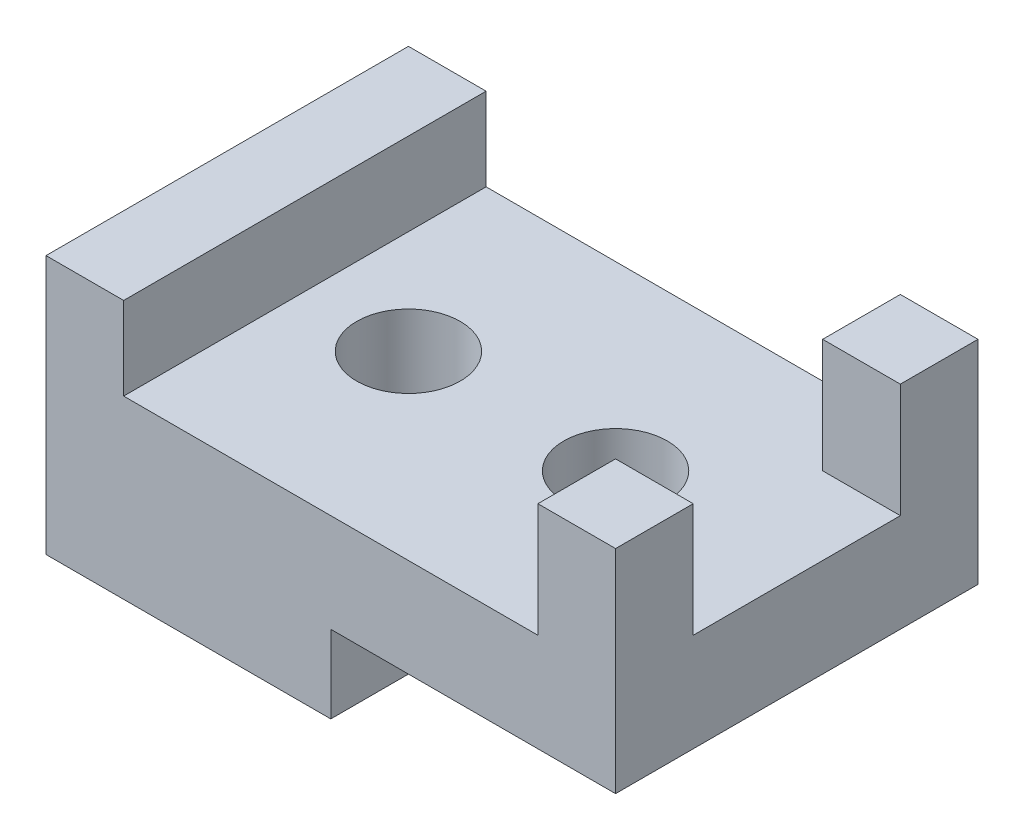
ISO-10303-21;
HEADER;
FILE_DESCRIPTION(('STEP AP214'),'2;1');
FILE_NAME('part.step','',(''),(''),'','','');
FILE_SCHEMA(('AUTOMOTIVE_DESIGN { 1 0 10303 214 1 1 1 1 }'));
ENDSEC;
DATA;
#1=APPLICATION_CONTEXT('core data for automotive mechanical design processes');
#2=APPLICATION_PROTOCOL_DEFINITION('international standard','automotive_design',2000,#1);
#3=PRODUCT_CONTEXT('',#1,'mechanical');
#4=PRODUCT('Part','Part','',(#3));
#5=PRODUCT_RELATED_PRODUCT_CATEGORY('part','',(#4));
#6=PRODUCT_DEFINITION_FORMATION('','',#4);
#7=PRODUCT_DEFINITION_CONTEXT('part definition',#1,'design');
#8=PRODUCT_DEFINITION('design','',#6,#7);
#9=PRODUCT_DEFINITION_SHAPE('','',#8);
#10=(LENGTH_UNIT() NAMED_UNIT(*) SI_UNIT(.MILLI.,.METRE.));
#11=(NAMED_UNIT(*) PLANE_ANGLE_UNIT() SI_UNIT($,.RADIAN.));
#12=(NAMED_UNIT(*) SI_UNIT($,.STERADIAN.) SOLID_ANGLE_UNIT());
#13=UNCERTAINTY_MEASURE_WITH_UNIT(LENGTH_MEASURE(1.E-05),#10,'distance_accuracy_value','');
#14=(GEOMETRIC_REPRESENTATION_CONTEXT(3) GLOBAL_UNCERTAINTY_ASSIGNED_CONTEXT((#13)) GLOBAL_UNIT_ASSIGNED_CONTEXT((#10,
#11,#12)) REPRESENTATION_CONTEXT('',''));
#15=CARTESIAN_POINT('',(0.,0.,0.));
#16=DIRECTION('',(0.,0.,1.));
#17=DIRECTION('',(1.,0.,0.));
#18=AXIS2_PLACEMENT_3D('',#15,#16,#17);
#19=CARTESIAN_POINT('',(110.,-16.,70.));
#20=DIRECTION('',(0.,-1.,0.));
#21=DIRECTION('',(1.,0.,0.));
#22=AXIS2_PLACEMENT_3D('',#19,#20,#21);
#23=PLANE('',#22);
#24=CARTESIAN_POINT('',(75.,-16.,35.));
#25=DIRECTION('',(0.,1.,0.));
#26=DIRECTION('',(-1.,0.,0.));
#27=AXIS2_PLACEMENT_3D('',#24,#25,#26);
#28=CIRCLE('',#27,9.99999999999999);
#29=CARTESIAN_POINT('',(65.,-16.,35.));
#30=VERTEX_POINT('',#29);
#31=EDGE_CURVE('E559',#30,#30,#28,.T.);
#32=ORIENTED_EDGE('',*,*,#31,.F.);
#33=EDGE_LOOP('',(#32));
#34=FACE_BOUND('',#33,.T.);
#35=CARTESIAN_POINT('',(35.,-16.,35.));
#36=DIRECTION('',(0.,1.,0.));
#37=DIRECTION('',(-1.,0.,0.));
#38=AXIS2_PLACEMENT_3D('',#35,#36,#37);
#39=CIRCLE('',#38,10.);
#40=CARTESIAN_POINT('',(25.,-16.,35.));
#41=VERTEX_POINT('',#40);
#42=EDGE_CURVE('E168',#41,#41,#39,.T.);
#43=ORIENTED_EDGE('',*,*,#42,.F.);
#44=EDGE_LOOP('',(#43));
#45=FACE_BOUND('',#44,.T.);
#46=DIRECTION('',(0.,0.,1.));
#47=VECTOR('',#46,1.);
#48=CARTESIAN_POINT('',(95.,-16.,0.));
#49=LINE('',#48,#47);
#50=CARTESIAN_POINT('',(95.,-16.,0.));
#51=VERTEX_POINT('',#50);
#52=CARTESIAN_POINT('',(95.,-16.,15.));
#53=VERTEX_POINT('',#52);
#54=EDGE_CURVE('E159',#51,#53,#49,.T.);
#55=ORIENTED_EDGE('',*,*,#54,.F.);
#56=DIRECTION('',(-1.,0.,0.));
#57=VECTOR('',#56,1.);
#58=CARTESIAN_POINT('',(110.,-16.,0.));
#59=LINE('',#58,#57);
#60=CARTESIAN_POINT('',(15.,-16.,0.));
#61=VERTEX_POINT('',#60);
#62=EDGE_CURVE('E147',#51,#61,#59,.T.);
#63=ORIENTED_EDGE('',*,*,#62,.T.);
#64=DIRECTION('',(0.,0.,-1.));
#65=VECTOR('',#64,1.);
#66=CARTESIAN_POINT('',(15.,-16.,70.));
#67=LINE('',#66,#65);
#68=CARTESIAN_POINT('',(15.,-16.,70.));
#69=VERTEX_POINT('',#68);
#70=EDGE_CURVE('E241',#69,#61,#67,.T.);
#71=ORIENTED_EDGE('',*,*,#70,.F.);
#72=DIRECTION('',(-1.,0.,0.));
#73=VECTOR('',#72,1.);
#74=CARTESIAN_POINT('',(110.,-16.,70.));
#75=LINE('',#74,#73);
#76=CARTESIAN_POINT('',(95.,-16.,70.));
#77=VERTEX_POINT('',#76);
#78=EDGE_CURVE('E222',#77,#69,#75,.T.);
#79=ORIENTED_EDGE('',*,*,#78,.F.);
#80=DIRECTION('',(0.,0.,1.));
#81=VECTOR('',#80,1.);
#82=CARTESIAN_POINT('',(95.,-16.,70.));
#83=LINE('',#82,#81);
#84=CARTESIAN_POINT('',(95.,-16.,55.));
#85=VERTEX_POINT('',#84);
#86=EDGE_CURVE('E191',#85,#77,#83,.T.);
#87=ORIENTED_EDGE('',*,*,#86,.F.);
#88=DIRECTION('',(-1.,0.,0.));
#89=VECTOR('',#88,1.);
#90=CARTESIAN_POINT('',(110.,-16.,55.));
#91=LINE('',#90,#89);
#92=CARTESIAN_POINT('',(110.,-16.,55.));
#93=VERTEX_POINT('',#92);
#94=EDGE_CURVE('E163',#93,#85,#91,.T.);
#95=ORIENTED_EDGE('',*,*,#94,.F.);
#96=DIRECTION('',(0.,0.,-1.));
#97=VECTOR('',#96,1.);
#98=CARTESIAN_POINT('',(110.,-16.,70.));
#99=LINE('',#98,#97);
#100=CARTESIAN_POINT('',(110.,-16.,15.));
#101=VERTEX_POINT('',#100);
#102=EDGE_CURVE('E66',#93,#101,#99,.T.);
#103=ORIENTED_EDGE('',*,*,#102,.T.);
#104=DIRECTION('',(1.,0.,0.));
#105=VECTOR('',#104,1.);
#106=CARTESIAN_POINT('',(110.,-16.,15.));
#107=LINE('',#106,#105);
#108=EDGE_CURVE('E61',#53,#101,#107,.T.);
#109=ORIENTED_EDGE('',*,*,#108,.F.);
#110=EDGE_LOOP('',(#55,#63,#71,#79,#87,#95,#103,#109));
#111=FACE_BOUND('',#110,.T.);
#112=ADVANCED_FACE('F45',(#34,#45,#111),#23,.F.);
#113=CARTESIAN_POINT('',(15.,0.,70.));
#114=DIRECTION('',(0.,-1.,0.));
#115=DIRECTION('',(1.,0.,0.));
#116=AXIS2_PLACEMENT_3D('',#113,#114,#115);
#117=PLANE('',#116);
#118=DIRECTION('',(-1.,0.,0.));
#119=VECTOR('',#118,1.);
#120=CARTESIAN_POINT('',(15.,0.,0.));
#121=LINE('',#120,#119);
#122=CARTESIAN_POINT('',(15.,0.,0.));
#123=VERTEX_POINT('',#122);
#124=CARTESIAN_POINT('',(0.,0.,0.));
#125=VERTEX_POINT('',#124);
#126=EDGE_CURVE('E208',#123,#125,#121,.T.);
#127=ORIENTED_EDGE('',*,*,#126,.T.);
#128=DIRECTION('',(0.,0.,-1.));
#129=VECTOR('',#128,1.);
#130=CARTESIAN_POINT('',(0.,0.,70.));
#131=LINE('',#130,#129);
#132=CARTESIAN_POINT('',(0.,0.,70.));
#133=VERTEX_POINT('',#132);
#134=EDGE_CURVE('E11',#133,#125,#131,.T.);
#135=ORIENTED_EDGE('',*,*,#134,.F.);
#136=DIRECTION('',(-1.,0.,0.));
#137=VECTOR('',#136,1.);
#138=CARTESIAN_POINT('',(15.,0.,70.));
#139=LINE('',#138,#137);
#140=CARTESIAN_POINT('',(15.,0.,70.));
#141=VERTEX_POINT('',#140);
#142=EDGE_CURVE('E209',#141,#133,#139,.T.);
#143=ORIENTED_EDGE('',*,*,#142,.F.);
#144=DIRECTION('',(0.,0.,-1.));
#145=VECTOR('',#144,1.);
#146=CARTESIAN_POINT('',(15.,0.,70.));
#147=LINE('',#146,#145);
#148=EDGE_CURVE('E226',#141,#123,#147,.T.);
#149=ORIENTED_EDGE('',*,*,#148,.T.);
#150=EDGE_LOOP('',(#127,#135,#143,#149));
#151=FACE_BOUND('',#150,.T.);
#152=ADVANCED_FACE('F47',(#151),#117,.F.);
#153=CARTESIAN_POINT('',(0.,0.,70.));
#154=DIRECTION('',(1.,0.,0.));
#155=DIRECTION('',(0.,0.,-1.));
#156=AXIS2_PLACEMENT_3D('',#153,#154,#155);
#157=PLANE('',#156);
#158=DIRECTION('',(0.,-1.,0.));
#159=VECTOR('',#158,1.);
#160=CARTESIAN_POINT('',(0.,0.,0.));
#161=LINE('',#160,#159);
#162=CARTESIAN_POINT('',(0.,-50.,0.));
#163=VERTEX_POINT('',#162);
#164=EDGE_CURVE('E229',#125,#163,#161,.T.);
#165=ORIENTED_EDGE('',*,*,#164,.T.);
#166=DIRECTION('',(0.,0.,-1.));
#167=VECTOR('',#166,1.);
#168=CARTESIAN_POINT('',(0.,-50.,70.));
#169=LINE('',#168,#167);
#170=CARTESIAN_POINT('',(0.,-50.,70.));
#171=VERTEX_POINT('',#170);
#172=EDGE_CURVE('E54',#171,#163,#169,.T.);
#173=ORIENTED_EDGE('',*,*,#172,.F.);
#174=DIRECTION('',(0.,-1.,0.));
#175=VECTOR('',#174,1.);
#176=CARTESIAN_POINT('',(0.,0.,70.));
#177=LINE('',#176,#175);
#178=EDGE_CURVE('E212',#133,#171,#177,.T.);
#179=ORIENTED_EDGE('',*,*,#178,.F.);
#180=ORIENTED_EDGE('',*,*,#134,.T.);
#181=EDGE_LOOP('',(#165,#173,#179,#180));
#182=FACE_BOUND('',#181,.T.);
#183=ADVANCED_FACE('F278',(#182),#157,.F.);
#184=CARTESIAN_POINT('',(0.,-50.,70.));
#185=DIRECTION('',(0.,1.,0.));
#186=DIRECTION('',(0.,0.,1.));
#187=AXIS2_PLACEMENT_3D('',#184,#185,#186);
#188=PLANE('',#187);
#189=DIRECTION('',(1.,0.,0.));
#190=VECTOR('',#189,1.);
#191=CARTESIAN_POINT('',(0.,-50.,0.));
#192=LINE('',#191,#190);
#193=CARTESIAN_POINT('',(55.,-50.,0.));
#194=VERTEX_POINT('',#193);
#195=EDGE_CURVE('E231',#163,#194,#192,.T.);
#196=ORIENTED_EDGE('',*,*,#195,.T.);
#197=DIRECTION('',(0.,0.,-1.));
#198=VECTOR('',#197,1.);
#199=CARTESIAN_POINT('',(55.,-50.,70.));
#200=LINE('',#199,#198);
#201=CARTESIAN_POINT('',(55.,-50.,70.));
#202=VERTEX_POINT('',#201);
#203=EDGE_CURVE('E250',#202,#194,#200,.T.);
#204=ORIENTED_EDGE('',*,*,#203,.F.);
#205=DIRECTION('',(1.,0.,0.));
#206=VECTOR('',#205,1.);
#207=CARTESIAN_POINT('',(0.,-50.,70.));
#208=LINE('',#207,#206);
#209=EDGE_CURVE('E214',#171,#202,#208,.T.);
#210=ORIENTED_EDGE('',*,*,#209,.F.);
#211=ORIENTED_EDGE('',*,*,#172,.T.);
#212=EDGE_LOOP('',(#196,#204,#210,#211));
#213=FACE_BOUND('',#212,.T.);
#214=ADVANCED_FACE('F258',(#213),#188,.F.);
#215=CARTESIAN_POINT('',(55.,-50.,70.));
#216=DIRECTION('',(-1.,0.,0.));
#217=DIRECTION('',(0.,0.,1.));
#218=AXIS2_PLACEMENT_3D('',#215,#216,#217);
#219=PLANE('',#218);
#220=DIRECTION('',(0.,1.,0.));
#221=VECTOR('',#220,1.);
#222=CARTESIAN_POINT('',(55.,-50.,0.));
#223=LINE('',#222,#221);
#224=CARTESIAN_POINT('',(55.,-35.,0.));
#225=VERTEX_POINT('',#224);
#226=EDGE_CURVE('E233',#194,#225,#223,.T.);
#227=ORIENTED_EDGE('',*,*,#226,.T.);
#228=DIRECTION('',(0.,0.,-1.));
#229=VECTOR('',#228,1.);
#230=CARTESIAN_POINT('',(55.,-35.,70.));
#231=LINE('',#230,#229);
#232=CARTESIAN_POINT('',(55.,-35.,70.));
#233=VERTEX_POINT('',#232);
#234=EDGE_CURVE('E247',#233,#225,#231,.T.);
#235=ORIENTED_EDGE('',*,*,#234,.F.);
#236=DIRECTION('',(0.,1.,0.));
#237=VECTOR('',#236,1.);
#238=CARTESIAN_POINT('',(55.,-50.,70.));
#239=LINE('',#238,#237);
#240=EDGE_CURVE('E216',#202,#233,#239,.T.);
#241=ORIENTED_EDGE('',*,*,#240,.F.);
#242=ORIENTED_EDGE('',*,*,#203,.T.);
#243=EDGE_LOOP('',(#227,#235,#241,#242));
#244=FACE_BOUND('',#243,.T.);
#245=ADVANCED_FACE('F266',(#244),#219,.F.);
#246=CARTESIAN_POINT('',(55.,-35.,70.));
#247=DIRECTION('',(0.,1.,0.));
#248=DIRECTION('',(0.,0.,1.));
#249=AXIS2_PLACEMENT_3D('',#246,#247,#248);
#250=PLANE('',#249);
#251=CARTESIAN_POINT('',(75.,-35.,35.));
#252=DIRECTION('',(0.,1.,0.));
#253=DIRECTION('',(0.,0.,1.));
#254=AXIS2_PLACEMENT_3D('',#251,#252,#253);
#255=CIRCLE('',#254,9.99999999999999);
#256=CARTESIAN_POINT('',(75.,-35.,45.));
#257=VERTEX_POINT('',#256);
#258=EDGE_CURVE('E49',#257,#257,#255,.T.);
#259=ORIENTED_EDGE('',*,*,#258,.T.);
#260=EDGE_LOOP('',(#259));
#261=FACE_BOUND('',#260,.T.);
#262=DIRECTION('',(1.,0.,0.));
#263=VECTOR('',#262,1.);
#264=CARTESIAN_POINT('',(55.,-35.,0.));
#265=LINE('',#264,#263);
#266=CARTESIAN_POINT('',(110.,-35.,0.));
#267=VERTEX_POINT('',#266);
#268=EDGE_CURVE('E235',#225,#267,#265,.T.);
#269=ORIENTED_EDGE('',*,*,#268,.T.);
#270=DIRECTION('',(0.,0.,-1.));
#271=VECTOR('',#270,1.);
#272=CARTESIAN_POINT('',(110.,-35.,70.));
#273=LINE('',#272,#271);
#274=CARTESIAN_POINT('',(110.,-35.,70.));
#275=VERTEX_POINT('',#274);
#276=EDGE_CURVE('E244',#275,#267,#273,.T.);
#277=ORIENTED_EDGE('',*,*,#276,.F.);
#278=DIRECTION('',(1.,0.,0.));
#279=VECTOR('',#278,1.);
#280=CARTESIAN_POINT('',(55.,-35.,70.));
#281=LINE('',#280,#279);
#282=EDGE_CURVE('E218',#233,#275,#281,.T.);
#283=ORIENTED_EDGE('',*,*,#282,.F.);
#284=ORIENTED_EDGE('',*,*,#234,.T.);
#285=EDGE_LOOP('',(#269,#277,#283,#284));
#286=FACE_BOUND('',#285,.T.);
#287=ADVANCED_FACE('F270',(#261,#286),#250,.F.);
#288=CARTESIAN_POINT('',(110.,-35.,70.));
#289=DIRECTION('',(-1.,0.,0.));
#290=DIRECTION('',(0.,0.,1.));
#291=AXIS2_PLACEMENT_3D('',#288,#289,#290);
#292=PLANE('',#291);
#293=DIRECTION('',(0.,1.,0.));
#294=VECTOR('',#293,1.);
#295=CARTESIAN_POINT('',(110.,-35.,0.));
#296=LINE('',#295,#294);
#297=CARTESIAN_POINT('',(110.,6.00000000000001,0.));
#298=VERTEX_POINT('',#297);
#299=EDGE_CURVE('E157',#267,#298,#296,.T.);
#300=ORIENTED_EDGE('',*,*,#299,.T.);
#301=DIRECTION('',(0.,0.,-1.));
#302=VECTOR('',#301,1.);
#303=CARTESIAN_POINT('',(110.,6.00000000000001,0.));
#304=LINE('',#303,#302);
#305=CARTESIAN_POINT('',(110.,6.00000000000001,15.));
#306=VERTEX_POINT('',#305);
#307=EDGE_CURVE('E179',#306,#298,#304,.T.);
#308=ORIENTED_EDGE('',*,*,#307,.F.);
#309=DIRECTION('',(0.,-1.,0.));
#310=VECTOR('',#309,1.);
#311=CARTESIAN_POINT('',(110.,6.00000000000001,15.));
#312=LINE('',#311,#310);
#313=EDGE_CURVE('E170',#306,#101,#312,.T.);
#314=ORIENTED_EDGE('',*,*,#313,.T.);
#315=ORIENTED_EDGE('',*,*,#102,.F.);
#316=DIRECTION('',(0.,-1.,0.));
#317=VECTOR('',#316,1.);
#318=CARTESIAN_POINT('',(110.,6.00000000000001,55.));
#319=LINE('',#318,#317);
#320=CARTESIAN_POINT('',(110.,6.00000000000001,55.));
#321=VERTEX_POINT('',#320);
#322=EDGE_CURVE('E206',#321,#93,#319,.T.);
#323=ORIENTED_EDGE('',*,*,#322,.F.);
#324=DIRECTION('',(0.,0.,-1.));
#325=VECTOR('',#324,1.);
#326=CARTESIAN_POINT('',(110.,6.00000000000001,70.));
#327=LINE('',#326,#325);
#328=CARTESIAN_POINT('',(110.,6.00000000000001,70.));
#329=VERTEX_POINT('',#328);
#330=EDGE_CURVE('E187',#329,#321,#327,.T.);
#331=ORIENTED_EDGE('',*,*,#330,.F.);
#332=DIRECTION('',(0.,1.,0.));
#333=VECTOR('',#332,1.);
#334=CARTESIAN_POINT('',(110.,-35.,70.));
#335=LINE('',#334,#333);
#336=EDGE_CURVE('E220',#275,#329,#335,.T.);
#337=ORIENTED_EDGE('',*,*,#336,.F.);
#338=ORIENTED_EDGE('',*,*,#276,.T.);
#339=EDGE_LOOP('',(#300,#308,#314,#315,#323,#331,#337,#338));
#340=FACE_BOUND('',#339,.T.);
#341=ADVANCED_FACE('F295',(#340),#292,.F.);
#342=CARTESIAN_POINT('',(15.,-16.,70.));
#343=DIRECTION('',(-1.,0.,0.));
#344=DIRECTION('',(0.,0.,1.));
#345=AXIS2_PLACEMENT_3D('',#342,#343,#344);
#346=PLANE('',#345);
#347=DIRECTION('',(0.,1.,0.));
#348=VECTOR('',#347,1.);
#349=CARTESIAN_POINT('',(15.,-16.,0.));
#350=LINE('',#349,#348);
#351=EDGE_CURVE('E154',#61,#123,#350,.T.);
#352=ORIENTED_EDGE('',*,*,#351,.T.);
#353=ORIENTED_EDGE('',*,*,#148,.F.);
#354=DIRECTION('',(0.,1.,0.));
#355=VECTOR('',#354,1.);
#356=CARTESIAN_POINT('',(15.,-16.,70.));
#357=LINE('',#356,#355);
#358=EDGE_CURVE('E224',#69,#141,#357,.T.);
#359=ORIENTED_EDGE('',*,*,#358,.F.);
#360=ORIENTED_EDGE('',*,*,#70,.T.);
#361=EDGE_LOOP('',(#352,#353,#359,#360));
#362=FACE_BOUND('',#361,.T.);
#363=ADVANCED_FACE('F283',(#362),#346,.F.);
#364=CARTESIAN_POINT('',(0.,0.,70.));
#365=DIRECTION('',(0.,0.,1.));
#366=DIRECTION('',(1.,0.,0.));
#367=AXIS2_PLACEMENT_3D('',#364,#365,#366);
#368=PLANE('',#367);
#369=ORIENTED_EDGE('',*,*,#142,.T.);
#370=ORIENTED_EDGE('',*,*,#178,.T.);
#371=ORIENTED_EDGE('',*,*,#209,.T.);
#372=ORIENTED_EDGE('',*,*,#240,.T.);
#373=ORIENTED_EDGE('',*,*,#282,.T.);
#374=ORIENTED_EDGE('',*,*,#336,.T.);
#375=DIRECTION('',(1.,0.,0.));
#376=VECTOR('',#375,1.);
#377=CARTESIAN_POINT('',(110.,6.00000000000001,70.));
#378=LINE('',#377,#376);
#379=CARTESIAN_POINT('',(95.,6.00000000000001,70.));
#380=VERTEX_POINT('',#379);
#381=EDGE_CURVE('E195',#380,#329,#378,.T.);
#382=ORIENTED_EDGE('',*,*,#381,.F.);
#383=DIRECTION('',(0.,-1.,0.));
#384=VECTOR('',#383,1.);
#385=CARTESIAN_POINT('',(95.,6.00000000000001,70.));
#386=LINE('',#385,#384);
#387=EDGE_CURVE('E198',#380,#77,#386,.T.);
#388=ORIENTED_EDGE('',*,*,#387,.T.);
#389=ORIENTED_EDGE('',*,*,#78,.T.);
#390=ORIENTED_EDGE('',*,*,#358,.T.);
#391=EDGE_LOOP('',(#369,#370,#371,#372,#373,#374,#382,#388,#389,#390));
#392=FACE_BOUND('',#391,.T.);
#393=ADVANCED_FACE('F274',(#392),#368,.T.);
#394=CARTESIAN_POINT('',(0.,0.,0.));
#395=DIRECTION('',(0.,0.,1.));
#396=DIRECTION('',(1.,0.,0.));
#397=AXIS2_PLACEMENT_3D('',#394,#395,#396);
#398=PLANE('',#397);
#399=ORIENTED_EDGE('',*,*,#126,.F.);
#400=ORIENTED_EDGE('',*,*,#351,.F.);
#401=ORIENTED_EDGE('',*,*,#62,.F.);
#402=DIRECTION('',(0.,-1.,0.));
#403=VECTOR('',#402,1.);
#404=CARTESIAN_POINT('',(95.,6.00000000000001,0.));
#405=LINE('',#404,#403);
#406=CARTESIAN_POINT('',(95.,6.00000000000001,0.));
#407=VERTEX_POINT('',#406);
#408=EDGE_CURVE('E152',#407,#51,#405,.T.);
#409=ORIENTED_EDGE('',*,*,#408,.F.);
#410=DIRECTION('',(-1.,0.,0.));
#411=VECTOR('',#410,1.);
#412=CARTESIAN_POINT('',(110.,6.00000000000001,0.));
#413=LINE('',#412,#411);
#414=EDGE_CURVE('E183',#298,#407,#413,.T.);
#415=ORIENTED_EDGE('',*,*,#414,.F.);
#416=ORIENTED_EDGE('',*,*,#299,.F.);
#417=ORIENTED_EDGE('',*,*,#268,.F.);
#418=ORIENTED_EDGE('',*,*,#226,.F.);
#419=ORIENTED_EDGE('',*,*,#195,.F.);
#420=ORIENTED_EDGE('',*,*,#164,.F.);
#421=EDGE_LOOP('',(#399,#400,#401,#409,#415,#416,#417,#418,#419,#420));
#422=FACE_BOUND('',#421,.T.);
#423=ADVANCED_FACE('F149',(#422),#398,.F.);
#424=CARTESIAN_POINT('',(110.,6.00000000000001,55.));
#425=DIRECTION('',(0.,0.,1.));
#426=DIRECTION('',(1.,0.,0.));
#427=AXIS2_PLACEMENT_3D('',#424,#425,#426);
#428=PLANE('',#427);
#429=ORIENTED_EDGE('',*,*,#94,.T.);
#430=DIRECTION('',(0.,-1.,0.));
#431=VECTOR('',#430,1.);
#432=CARTESIAN_POINT('',(95.,6.00000000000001,55.));
#433=LINE('',#432,#431);
#434=CARTESIAN_POINT('',(95.,6.00000000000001,55.));
#435=VERTEX_POINT('',#434);
#436=EDGE_CURVE('E203',#435,#85,#433,.T.);
#437=ORIENTED_EDGE('',*,*,#436,.F.);
#438=DIRECTION('',(-1.,0.,0.));
#439=VECTOR('',#438,1.);
#440=CARTESIAN_POINT('',(110.,6.00000000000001,55.));
#441=LINE('',#440,#439);
#442=EDGE_CURVE('E190',#321,#435,#441,.T.);
#443=ORIENTED_EDGE('',*,*,#442,.F.);
#444=ORIENTED_EDGE('',*,*,#322,.T.);
#445=EDGE_LOOP('',(#429,#437,#443,#444));
#446=FACE_BOUND('',#445,.T.);
#447=ADVANCED_FACE('F292',(#446),#428,.F.);
#448=CARTESIAN_POINT('',(95.,6.00000000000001,70.));
#449=DIRECTION('',(1.,0.,0.));
#450=DIRECTION('',(0.,1.,0.));
#451=AXIS2_PLACEMENT_3D('',#448,#449,#450);
#452=PLANE('',#451);
#453=ORIENTED_EDGE('',*,*,#86,.T.);
#454=ORIENTED_EDGE('',*,*,#387,.F.);
#455=DIRECTION('',(0.,0.,1.));
#456=VECTOR('',#455,1.);
#457=CARTESIAN_POINT('',(95.,6.00000000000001,70.));
#458=LINE('',#457,#456);
#459=EDGE_CURVE('E193',#435,#380,#458,.T.);
#460=ORIENTED_EDGE('',*,*,#459,.F.);
#461=ORIENTED_EDGE('',*,*,#436,.T.);
#462=EDGE_LOOP('',(#453,#454,#460,#461));
#463=FACE_BOUND('',#462,.T.);
#464=ADVANCED_FACE('F289',(#463),#452,.F.);
#465=CARTESIAN_POINT('',(0.,6.00000000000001,0.));
#466=DIRECTION('',(0.,1.,0.));
#467=DIRECTION('',(0.,0.,1.));
#468=AXIS2_PLACEMENT_3D('',#465,#466,#467);
#469=PLANE('',#468);
#470=ORIENTED_EDGE('',*,*,#330,.T.);
#471=ORIENTED_EDGE('',*,*,#442,.T.);
#472=ORIENTED_EDGE('',*,*,#459,.T.);
#473=ORIENTED_EDGE('',*,*,#381,.T.);
#474=EDGE_LOOP('',(#470,#471,#472,#473));
#475=FACE_BOUND('',#474,.T.);
#476=ADVANCED_FACE('F305',(#475),#469,.T.);
#477=CARTESIAN_POINT('',(95.,6.00000000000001,0.));
#478=DIRECTION('',(1.,0.,0.));
#479=DIRECTION('',(0.,1.,0.));
#480=AXIS2_PLACEMENT_3D('',#477,#478,#479);
#481=PLANE('',#480);
#482=ORIENTED_EDGE('',*,*,#54,.T.);
#483=DIRECTION('',(0.,-1.,0.));
#484=VECTOR('',#483,1.);
#485=CARTESIAN_POINT('',(95.,6.00000000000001,15.));
#486=LINE('',#485,#484);
#487=CARTESIAN_POINT('',(95.,6.00000000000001,15.));
#488=VERTEX_POINT('',#487);
#489=EDGE_CURVE('E167',#488,#53,#486,.T.);
#490=ORIENTED_EDGE('',*,*,#489,.F.);
#491=DIRECTION('',(0.,0.,1.));
#492=VECTOR('',#491,1.);
#493=CARTESIAN_POINT('',(95.,6.00000000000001,0.));
#494=LINE('',#493,#492);
#495=EDGE_CURVE('E166',#407,#488,#494,.T.);
#496=ORIENTED_EDGE('',*,*,#495,.F.);
#497=ORIENTED_EDGE('',*,*,#408,.T.);
#498=EDGE_LOOP('',(#482,#490,#496,#497));
#499=FACE_BOUND('',#498,.T.);
#500=ADVANCED_FACE('F165',(#499),#481,.F.);
#501=CARTESIAN_POINT('',(110.,6.00000000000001,15.));
#502=DIRECTION('',(0.,0.,-1.));
#503=DIRECTION('',(-1.,0.,0.));
#504=AXIS2_PLACEMENT_3D('',#501,#502,#503);
#505=PLANE('',#504);
#506=ORIENTED_EDGE('',*,*,#108,.T.);
#507=ORIENTED_EDGE('',*,*,#313,.F.);
#508=DIRECTION('',(1.,0.,0.));
#509=VECTOR('',#508,1.);
#510=CARTESIAN_POINT('',(110.,6.00000000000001,15.));
#511=LINE('',#510,#509);
#512=EDGE_CURVE('E178',#488,#306,#511,.T.);
#513=ORIENTED_EDGE('',*,*,#512,.F.);
#514=ORIENTED_EDGE('',*,*,#489,.T.);
#515=EDGE_LOOP('',(#506,#507,#513,#514));
#516=FACE_BOUND('',#515,.T.);
#517=ADVANCED_FACE('F301',(#516),#505,.F.);
#518=CARTESIAN_POINT('',(0.,6.00000000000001,0.));
#519=DIRECTION('',(0.,-1.,0.));
#520=DIRECTION('',(0.,0.,-1.));
#521=AXIS2_PLACEMENT_3D('',#518,#519,#520);
#522=PLANE('',#521);
#523=ORIENTED_EDGE('',*,*,#307,.T.);
#524=ORIENTED_EDGE('',*,*,#414,.T.);
#525=ORIENTED_EDGE('',*,*,#495,.T.);
#526=ORIENTED_EDGE('',*,*,#512,.T.);
#527=EDGE_LOOP('',(#523,#524,#525,#526));
#528=FACE_BOUND('',#527,.T.);
#529=ADVANCED_FACE('F303',(#528),#522,.F.);
#530=CARTESIAN_POINT('',(35.,-26.,35.));
#531=DIRECTION('',(0.,1.,0.));
#532=DIRECTION('',(-1.,0.,0.));
#533=AXIS2_PLACEMENT_3D('',#530,#531,#532);
#534=CYLINDRICAL_SURFACE('',#533,10.);
#535=ORIENTED_EDGE('',*,*,#42,.T.);
#536=EDGE_LOOP('',(#535));
#537=FACE_BOUND('',#536,.T.);
#538=CARTESIAN_POINT('',(35.,-36.,35.));
#539=DIRECTION('',(0.,1.,0.));
#540=DIRECTION('',(-1.,0.,0.));
#541=AXIS2_PLACEMENT_3D('',#538,#539,#540);
#542=CIRCLE('',#541,10.);
#543=CARTESIAN_POINT('',(25.,-36.,35.));
#544=VERTEX_POINT('',#543);
#545=EDGE_CURVE('E562',#544,#544,#542,.T.);
#546=ORIENTED_EDGE('',*,*,#545,.F.);
#547=EDGE_LOOP('',(#546));
#548=FACE_BOUND('',#547,.T.);
#549=ADVANCED_FACE('F408',(#537,#548),#534,.F.);
#550=CARTESIAN_POINT('',(35.,-36.,35.));
#551=DIRECTION('',(0.,1.,0.));
#552=DIRECTION('',(-1.,0.,0.));
#553=AXIS2_PLACEMENT_3D('',#550,#551,#552);
#554=PLANE('',#553);
#555=ORIENTED_EDGE('',*,*,#545,.T.);
#556=EDGE_LOOP('',(#555));
#557=FACE_BOUND('',#556,.T.);
#558=ADVANCED_FACE('F417',(#557),#554,.T.);
#559=CARTESIAN_POINT('',(75.,-36.,35.));
#560=DIRECTION('',(0.,1.,0.));
#561=DIRECTION('',(-1.,0.,0.));
#562=AXIS2_PLACEMENT_3D('',#559,#560,#561);
#563=CYLINDRICAL_SURFACE('',#562,9.99999999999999);
#564=ORIENTED_EDGE('',*,*,#31,.T.);
#565=EDGE_LOOP('',(#564));
#566=FACE_BOUND('',#565,.T.);
#567=ORIENTED_EDGE('',*,*,#258,.F.);
#568=EDGE_LOOP('',(#567));
#569=FACE_BOUND('',#568,.T.);
#570=ADVANCED_FACE('F427',(#566,#569),#563,.F.);
#571=CLOSED_SHELL('',(#112,#152,#183,#214,#245,#287,#341,#363,#393,#423,#447,#464,#476,#500,
#517,#529,#549,#558,#570));
#572=MANIFOLD_SOLID_BREP('B2',#571);
#573=ADVANCED_BREP_SHAPE_REPRESENTATION('',(#18,#572),#14);
#574=SHAPE_DEFINITION_REPRESENTATION(#9,#573);
ENDSEC;
END-ISO-10303-21;
